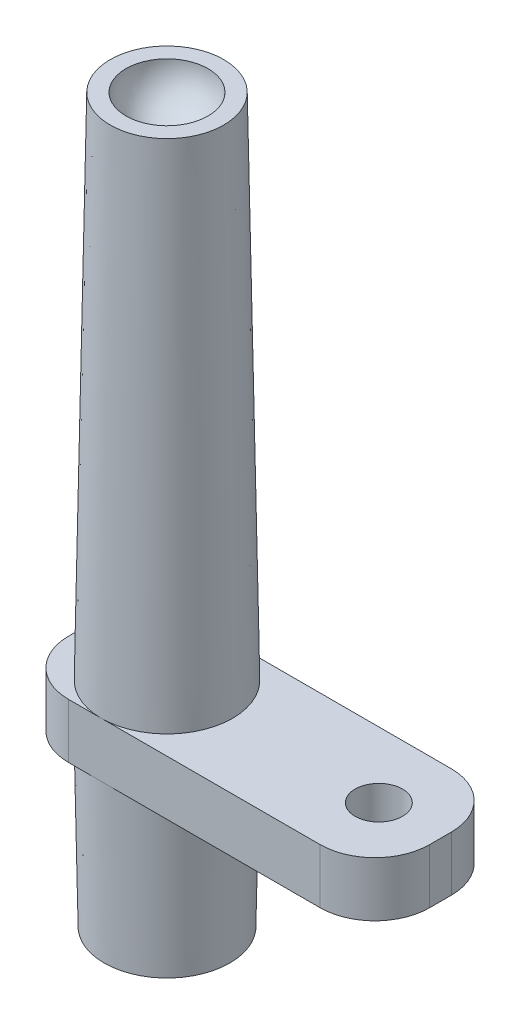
ISO-10303-21;
HEADER;
FILE_DESCRIPTION(('STEP AP214'),'2;1');
FILE_NAME('part.step','',(''),(''),'','','');
FILE_SCHEMA(('AUTOMOTIVE_DESIGN { 1 0 10303 214 1 1 1 1 }'));
ENDSEC;
DATA;
#1=APPLICATION_CONTEXT('core data for automotive mechanical design processes');
#2=APPLICATION_PROTOCOL_DEFINITION('international standard','automotive_design',2000,#1);
#3=PRODUCT_CONTEXT('',#1,'mechanical');
#4=PRODUCT('Part','Part','',(#3));
#5=PRODUCT_RELATED_PRODUCT_CATEGORY('part','',(#4));
#6=PRODUCT_DEFINITION_FORMATION('','',#4);
#7=PRODUCT_DEFINITION_CONTEXT('part definition',#1,'design');
#8=PRODUCT_DEFINITION('design','',#6,#7);
#9=PRODUCT_DEFINITION_SHAPE('','',#8);
#10=(LENGTH_UNIT() NAMED_UNIT(*) SI_UNIT(.MILLI.,.METRE.));
#11=(NAMED_UNIT(*) PLANE_ANGLE_UNIT() SI_UNIT($,.RADIAN.));
#12=(NAMED_UNIT(*) SI_UNIT($,.STERADIAN.) SOLID_ANGLE_UNIT());
#13=UNCERTAINTY_MEASURE_WITH_UNIT(LENGTH_MEASURE(1.E-05),#10,'distance_accuracy_value','');
#14=(GEOMETRIC_REPRESENTATION_CONTEXT(3) GLOBAL_UNCERTAINTY_ASSIGNED_CONTEXT((#13)) GLOBAL_UNIT_ASSIGNED_CONTEXT((#10,
#11,#12)) REPRESENTATION_CONTEXT('',''));
#15=CARTESIAN_POINT('',(0.,0.,0.));
#16=DIRECTION('',(0.,0.,1.));
#17=DIRECTION('',(1.,0.,0.));
#18=AXIS2_PLACEMENT_3D('',#15,#16,#17);
#19=CARTESIAN_POINT('',(-2.159,-4.064,0.));
#20=CARTESIAN_POINT('',(-2.126290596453,-4.044393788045,-0.5199010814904));
#21=CARTESIAN_POINT('',(-2.094655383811,-3.910545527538,-1.022728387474));
#22=CARTESIAN_POINT('',(-2.065647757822,-3.669027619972,-1.483791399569));
#23=CARTESIAN_POINT('',(-2.159,-4.064,0.));
#24=CARTESIAN_POINT('',(-2.446236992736,-4.044393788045,-0.5400304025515));
#25=CARTESIAN_POINT('',(-2.724040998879,-3.910545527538,-1.06232597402));
#26=CARTESIAN_POINT('',(-2.978770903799,-3.669027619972,-1.54124023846));
#27=CARTESIAN_POINT('',(-2.159,-4.064,0.));
#28=CARTESIAN_POINT('',(-2.679929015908,-4.044393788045,-0.3205789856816));
#29=CARTESIAN_POINT('',(-3.183750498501,-3.910545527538,-0.6306300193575));
#30=CARTESIAN_POINT('',(-3.645725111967,-3.669027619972,-0.9149285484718));
#31=CARTESIAN_POINT('',(-2.159,-4.064,0.));
#32=CARTESIAN_POINT('',(-2.679929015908,-4.044393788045,0.));
#33=CARTESIAN_POINT('',(-3.183750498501,-3.910545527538,0.));
#34=CARTESIAN_POINT('',(-3.645725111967,-3.669027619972,0.));
#35=CARTESIAN_POINT('',(-2.159,-4.064,0.));
#36=CARTESIAN_POINT('',(-2.679929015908,-4.044393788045,0.3205789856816));
#37=CARTESIAN_POINT('',(-3.183750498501,-3.910545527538,0.6306300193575));
#38=CARTESIAN_POINT('',(-3.645725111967,-3.669027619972,0.9149285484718));
#39=CARTESIAN_POINT('',(-2.159,-4.064,0.));
#40=CARTESIAN_POINT('',(-2.446236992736,-4.044393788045,0.5400304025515));
#41=CARTESIAN_POINT('',(-2.724040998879,-3.910545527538,1.06232597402));
#42=CARTESIAN_POINT('',(-2.978770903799,-3.669027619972,1.54124023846));
#43=CARTESIAN_POINT('',(-2.159,-4.064,0.));
#44=CARTESIAN_POINT('',(-2.126290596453,-4.044393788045,0.5199010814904));
#45=CARTESIAN_POINT('',(-2.094655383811,-3.910545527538,1.022728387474));
#46=CARTESIAN_POINT('',(-2.065647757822,-3.669027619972,1.483791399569));
#47=(BOUNDED_SURFACE() B_SPLINE_SURFACE(3,3,((#19,#20,#21,#22),(#23,#24,#25,#26),(#27,#28,#29,
#30),(#31,#32,#33,#34),(#35,#36,#37,#38),(#39,#40,#41,#42),(#43,#44,#45,#46)),.UNSPECIFIED.,.F.,
.F.,.F.) B_SPLINE_SURFACE_WITH_KNOTS((4,3,4),(4,4),(0.,1.,2.),(0.,1.),
.UNSPECIFIED.) GEOMETRIC_REPRESENTATION_ITEM() RATIONAL_B_SPLINE_SURFACE(((1.202018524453,
1.182344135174,1.182344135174,1.202018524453),(0.9492317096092,0.9336948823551,0.9336948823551,
0.9492317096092),(0.9492317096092,0.9336948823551,0.9336948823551,0.9492317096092),
(1.202018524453,1.182344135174,1.182344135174,1.202018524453),(0.9492317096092,0.9336948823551,
0.9336948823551,0.9492317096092),(0.9492317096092,0.9336948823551,0.9336948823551,
0.9492317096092),(1.202018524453,1.182344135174,1.182344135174,1.202018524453))) REPRESENTATION_ITEM('') SURFACE());
#48=CARTESIAN_POINT('',(-2.15900000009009,-0.573971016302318,0.131354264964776));
#49=DIRECTION('',(1.,-3.19033628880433E-13,6.9481776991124E-10));
#50=DIRECTION('',(6.9481776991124E-10,0.,-1.));
#51=AXIS2_PLACEMENT_3D('',#48,#49,#50);
#52=CIRCLE('',#51,3.49249999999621);
#53=CARTESIAN_POINT('',(-2.15899999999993,-4.06399999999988,0.));
#54=VERTEX_POINT('',#53);
#55=CARTESIAN_POINT('',(-2.1589999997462,-3.68300000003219,-1.45971299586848));
#56=VERTEX_POINT('',#55);
#57=EDGE_CURVE('E108',#54,#56,#52,.T.);
#58=CARTESIAN_POINT('',(-2.1589999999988,-0.573971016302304,-0.131354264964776));
#59=DIRECTION('',(1.,-3.1778407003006E-13,1.86788451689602E-13));
#60=DIRECTION('',(3.1778407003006E-13,1.,0.));
#61=AXIS2_PLACEMENT_3D('',#58,#59,#60);
#62=CIRCLE('',#61,3.49249999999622);
#63=CARTESIAN_POINT('',(-2.15900000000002,-3.68300000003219,1.45971299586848));
#64=VERTEX_POINT('',#63);
#65=EDGE_CURVE('E110',#64,#54,#62,.T.);
#66=CARTESIAN_POINT('',(-2.159,-3.68300000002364,0.));
#67=DIRECTION('',(0.,1.,0.));
#68=DIRECTION('',(0.,0.,1.));
#69=AXIS2_PLACEMENT_3D('',#66,#67,#68);
#70=CIRCLE('',#69,1.45971299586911);
#71=EDGE_CURVE('E105',#56,#64,#70,.T.);
#72=ORIENTED_EDGE('',*,*,#57,.F.);
#73=ORIENTED_EDGE('',*,*,#65,.F.);
#74=ORIENTED_EDGE('',*,*,#71,.F.);
#75=EDGE_LOOP('',(#72,#73,#74));
#76=FACE_BOUND('',#75,.T.);
#77=ADVANCED_FACE('F17',(#76),#47,.T.);
#78=CARTESIAN_POINT('',(-2.159,-4.064,0.));
#79=CARTESIAN_POINT('',(-2.191709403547,-4.044393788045,0.5199010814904));
#80=CARTESIAN_POINT('',(-2.223344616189,-3.910545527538,1.022728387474));
#81=CARTESIAN_POINT('',(-2.252352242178,-3.669027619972,1.483791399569));
#82=CARTESIAN_POINT('',(-2.159,-4.064,0.));
#83=CARTESIAN_POINT('',(-1.871763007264,-4.044393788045,0.5400304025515));
#84=CARTESIAN_POINT('',(-1.593959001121,-3.910545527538,1.06232597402));
#85=CARTESIAN_POINT('',(-1.339229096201,-3.669027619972,1.54124023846));
#86=CARTESIAN_POINT('',(-2.159,-4.064,0.));
#87=CARTESIAN_POINT('',(-1.638070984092,-4.044393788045,0.3205789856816));
#88=CARTESIAN_POINT('',(-1.134249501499,-3.910545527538,0.6306300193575));
#89=CARTESIAN_POINT('',(-0.6722748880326,-3.669027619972,0.9149285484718));
#90=CARTESIAN_POINT('',(-2.159,-4.064,0.));
#91=CARTESIAN_POINT('',(-1.638070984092,-4.044393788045,0.));
#92=CARTESIAN_POINT('',(-1.134249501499,-3.910545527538,0.));
#93=CARTESIAN_POINT('',(-0.6722748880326,-3.669027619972,0.));
#94=CARTESIAN_POINT('',(-2.159,-4.064,0.));
#95=CARTESIAN_POINT('',(-1.638070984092,-4.044393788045,-0.3205789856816));
#96=CARTESIAN_POINT('',(-1.134249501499,-3.910545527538,-0.6306300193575));
#97=CARTESIAN_POINT('',(-0.6722748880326,-3.669027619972,-0.9149285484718));
#98=CARTESIAN_POINT('',(-2.159,-4.064,0.));
#99=CARTESIAN_POINT('',(-1.871763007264,-4.044393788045,-0.5400304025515));
#100=CARTESIAN_POINT('',(-1.593959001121,-3.910545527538,-1.06232597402));
#101=CARTESIAN_POINT('',(-1.339229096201,-3.669027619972,-1.54124023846));
#102=CARTESIAN_POINT('',(-2.159,-4.064,0.));
#103=CARTESIAN_POINT('',(-2.191709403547,-4.044393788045,-0.5199010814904));
#104=CARTESIAN_POINT('',(-2.223344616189,-3.910545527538,-1.022728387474));
#105=CARTESIAN_POINT('',(-2.252352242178,-3.669027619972,-1.483791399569));
#106=(BOUNDED_SURFACE() B_SPLINE_SURFACE(3,3,((#78,#79,#80,#81),(#82,#83,#84,#85),(#86,#87,#88,
#89),(#90,#91,#92,#93),(#94,#95,#96,#97),(#98,#99,#100,#101),(#102,#103,#104,#105)),
.UNSPECIFIED.,.F.,.F.,.F.) B_SPLINE_SURFACE_WITH_KNOTS((4,3,4),(4,4),(0.,1.,2.),(0.,1.),
.UNSPECIFIED.) GEOMETRIC_REPRESENTATION_ITEM() RATIONAL_B_SPLINE_SURFACE(((1.202018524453,
1.182344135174,1.182344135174,1.202018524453),(0.9492317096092,0.9336948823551,0.9336948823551,
0.9492317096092),(0.9492317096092,0.9336948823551,0.9336948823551,0.9492317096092),
(1.202018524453,1.182344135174,1.182344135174,1.202018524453),(0.9492317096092,0.9336948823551,
0.9336948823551,0.9492317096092),(0.9492317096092,0.9336948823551,0.9336948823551,
0.9492317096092),(1.202018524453,1.182344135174,1.182344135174,1.202018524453))) REPRESENTATION_ITEM('') SURFACE());
#107=CARTESIAN_POINT('',(-2.159,-3.68300000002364,0.));
#108=DIRECTION('',(0.,1.,0.));
#109=DIRECTION('',(0.,0.,1.));
#110=AXIS2_PLACEMENT_3D('',#107,#108,#109);
#111=CIRCLE('',#110,1.45971299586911);
#112=EDGE_CURVE('E116',#64,#56,#111,.T.);
#113=ORIENTED_EDGE('',*,*,#65,.T.);
#114=ORIENTED_EDGE('',*,*,#57,.T.);
#115=ORIENTED_EDGE('',*,*,#112,.F.);
#116=EDGE_LOOP('',(#113,#114,#115));
#117=FACE_BOUND('',#116,.T.);
#118=ADVANCED_FACE('F115',(#117),#106,.T.);
#119=CARTESIAN_POINT('',(-2.159,-5.6843418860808E-11,0.));
#120=DIRECTION('',(0.,1.,0.));
#121=DIRECTION('',(0.,0.,1.));
#122=AXIS2_PLACEMENT_3D('',#119,#120,#121);
#123=CONICAL_SURFACE('',#122,1.52399999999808,0.0174532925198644);
#124=CARTESIAN_POINT('',(-2.159,0.,0.));
#125=DIRECTION('',(0.,1.,0.));
#126=DIRECTION('',(0.,0.,1.));
#127=AXIS2_PLACEMENT_3D('',#124,#125,#126);
#128=CIRCLE('',#127,1.52399999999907);
#129=CARTESIAN_POINT('',(-2.159,-1.4210854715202E-11,1.52399999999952));
#130=VERTEX_POINT('',#129);
#131=CARTESIAN_POINT('',(-2.15899999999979,-1.42143783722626E-11,-1.52399999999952));
#132=VERTEX_POINT('',#131);
#133=EDGE_CURVE('E21',#130,#132,#128,.F.);
#134=ORIENTED_EDGE('',*,*,#133,.T.);
#135=CARTESIAN_POINT('',(-2.159,0.,0.));
#136=DIRECTION('',(0.,1.,0.));
#137=DIRECTION('',(0.,0.,1.));
#138=AXIS2_PLACEMENT_3D('',#135,#136,#137);
#139=CIRCLE('',#138,1.52399999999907);
#140=EDGE_CURVE('E174',#132,#130,#139,.F.);
#141=ORIENTED_EDGE('',*,*,#140,.T.);
#142=EDGE_LOOP('',(#134,#141));
#143=FACE_BOUND('',#142,.T.);
#144=ORIENTED_EDGE('',*,*,#112,.T.);
#145=ORIENTED_EDGE('',*,*,#71,.T.);
#146=EDGE_LOOP('',(#144,#145));
#147=FACE_BOUND('',#146,.T.);
#148=ADVANCED_FACE('F193',(#143,#147),#123,.T.);
#149=CARTESIAN_POINT('',(-4.191,0.,1.524));
#150=DIRECTION('',(0.,1.,0.));
#151=DIRECTION('',(0.,0.,1.));
#152=AXIS2_PLACEMENT_3D('',#149,#150,#151);
#153=PLANE('',#152);
#154=CARTESIAN_POINT('',(-2.921,0.,-0.254));
#155=DIRECTION('',(0.,-1.,0.));
#156=DIRECTION('',(0.,0.,-1.));
#157=AXIS2_PLACEMENT_3D('',#154,#155,#156);
#158=CIRCLE('',#157,1.27);
#159=CARTESIAN_POINT('',(-2.921,0.,-1.52399999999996));
#160=VERTEX_POINT('',#159);
#161=CARTESIAN_POINT('',(-4.191,0.,-0.254));
#162=VERTEX_POINT('',#161);
#163=EDGE_CURVE('E171',#160,#162,#158,.F.);
#164=ORIENTED_EDGE('',*,*,#163,.F.);
#165=DIRECTION('',(1.,0.,0.));
#166=VECTOR('',#165,1.);
#167=CARTESIAN_POINT('',(-4.191,0.,-1.52399999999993));
#168=LINE('',#167,#166);
#169=EDGE_CURVE('E176',#132,#160,#168,.F.);
#170=ORIENTED_EDGE('',*,*,#169,.F.);
#171=ORIENTED_EDGE('',*,*,#133,.F.);
#172=DIRECTION('',(1.,0.,0.));
#173=VECTOR('',#172,1.);
#174=CARTESIAN_POINT('',(-4.191,0.,1.524));
#175=LINE('',#174,#173);
#176=CARTESIAN_POINT('',(-2.921,0.,1.524));
#177=VERTEX_POINT('',#176);
#178=EDGE_CURVE('E96',#177,#130,#175,.T.);
#179=ORIENTED_EDGE('',*,*,#178,.F.);
#180=CARTESIAN_POINT('',(-2.921,0.,0.254));
#181=DIRECTION('',(0.,-1.,0.));
#182=DIRECTION('',(0.,0.,-1.));
#183=AXIS2_PLACEMENT_3D('',#180,#181,#182);
#184=CIRCLE('',#183,1.27);
#185=CARTESIAN_POINT('',(-4.191,0.,0.254));
#186=VERTEX_POINT('',#185);
#187=EDGE_CURVE('E167',#186,#177,#184,.F.);
#188=ORIENTED_EDGE('',*,*,#187,.F.);
#189=DIRECTION('',(0.,0.,-1.));
#190=VECTOR('',#189,1.);
#191=CARTESIAN_POINT('',(-4.191,0.,-1.524));
#192=LINE('',#191,#190);
#193=EDGE_CURVE('E173',#186,#162,#192,.T.);
#194=ORIENTED_EDGE('',*,*,#193,.T.);
#195=EDGE_LOOP('',(#164,#170,#171,#179,#188,#194));
#196=FACE_BOUND('',#195,.T.);
#197=ADVANCED_FACE('F195',(#196),#153,.F.);
#198=CARTESIAN_POINT('',(-4.191,0.,1.524));
#199=DIRECTION('',(0.,1.,0.));
#200=DIRECTION('',(0.,0.,1.));
#201=AXIS2_PLACEMENT_3D('',#198,#199,#200);
#202=PLANE('',#201);
#203=ORIENTED_EDGE('',*,*,#140,.F.);
#204=DIRECTION('',(1.,0.,0.));
#205=VECTOR('',#204,1.);
#206=CARTESIAN_POINT('',(-4.191,0.,-1.524));
#207=LINE('',#206,#205);
#208=CARTESIAN_POINT('',(2.921,0.,-1.524));
#209=VERTEX_POINT('',#208);
#210=EDGE_CURVE('E154',#132,#209,#207,.T.);
#211=ORIENTED_EDGE('',*,*,#210,.T.);
#212=CARTESIAN_POINT('',(2.921,0.,-0.254));
#213=DIRECTION('',(0.,-1.,0.));
#214=DIRECTION('',(0.,0.,-1.));
#215=AXIS2_PLACEMENT_3D('',#212,#213,#214);
#216=CIRCLE('',#215,1.27);
#217=CARTESIAN_POINT('',(4.191,0.,-0.254));
#218=VERTEX_POINT('',#217);
#219=EDGE_CURVE('E155',#218,#209,#216,.F.);
#220=ORIENTED_EDGE('',*,*,#219,.F.);
#221=DIRECTION('',(0.,0.,1.));
#222=VECTOR('',#221,1.);
#223=CARTESIAN_POINT('',(4.191,0.,-1.524));
#224=LINE('',#223,#222);
#225=CARTESIAN_POINT('',(4.191,0.,0.254));
#226=VERTEX_POINT('',#225);
#227=EDGE_CURVE('E287',#218,#226,#224,.T.);
#228=ORIENTED_EDGE('',*,*,#227,.T.);
#229=CARTESIAN_POINT('',(2.921,0.,0.254));
#230=DIRECTION('',(0.,-1.,0.));
#231=DIRECTION('',(0.,0.,-1.));
#232=AXIS2_PLACEMENT_3D('',#229,#230,#231);
#233=CIRCLE('',#232,1.27);
#234=CARTESIAN_POINT('',(2.921,0.,1.524));
#235=VERTEX_POINT('',#234);
#236=EDGE_CURVE('E159',#235,#226,#233,.F.);
#237=ORIENTED_EDGE('',*,*,#236,.F.);
#238=DIRECTION('',(-1.,0.,0.));
#239=VECTOR('',#238,1.);
#240=CARTESIAN_POINT('',(-4.191,0.,1.524));
#241=LINE('',#240,#239);
#242=EDGE_CURVE('E166',#235,#130,#241,.T.);
#243=ORIENTED_EDGE('',*,*,#242,.T.);
#244=EDGE_LOOP('',(#203,#211,#220,#228,#237,#243));
#245=FACE_BOUND('',#244,.T.);
#246=CARTESIAN_POINT('',(2.75844,0.,0.));
#247=DIRECTION('',(0.,1.,0.));
#248=DIRECTION('',(0.,0.,1.));
#249=AXIS2_PLACEMENT_3D('',#246,#247,#248);
#250=CIRCLE('',#249,0.55);
#251=CARTESIAN_POINT('',(2.75844,0.,0.55));
#252=VERTEX_POINT('',#251);
#253=EDGE_CURVE('E163',#252,#252,#250,.T.);
#254=ORIENTED_EDGE('',*,*,#253,.T.);
#255=EDGE_LOOP('',(#254));
#256=FACE_BOUND('',#255,.T.);
#257=ADVANCED_FACE('F202',(#245,#256),#202,.F.);
#258=CARTESIAN_POINT('',(-2.921,1.27,-0.254));
#259=DIRECTION('',(0.,-1.,0.));
#260=DIRECTION('',(0.,0.,-1.));
#261=AXIS2_PLACEMENT_3D('',#258,#259,#260);
#262=CYLINDRICAL_SURFACE('',#261,1.27);
#263=DIRECTION('',(0.,1.,0.));
#264=VECTOR('',#263,1.);
#265=CARTESIAN_POINT('',(-2.921,1.27,-1.524));
#266=LINE('',#265,#264);
#267=CARTESIAN_POINT('',(-2.921,1.27,-1.52399999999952));
#268=VERTEX_POINT('',#267);
#269=EDGE_CURVE('E276',#268,#160,#266,.F.);
#270=ORIENTED_EDGE('',*,*,#269,.T.);
#271=ORIENTED_EDGE('',*,*,#163,.T.);
#272=DIRECTION('',(0.,1.,0.));
#273=VECTOR('',#272,1.);
#274=CARTESIAN_POINT('',(-4.191,1.27,-0.254));
#275=LINE('',#274,#273);
#276=CARTESIAN_POINT('',(-4.191,1.27,-0.254));
#277=VERTEX_POINT('',#276);
#278=EDGE_CURVE('E189',#162,#277,#275,.T.);
#279=ORIENTED_EDGE('',*,*,#278,.T.);
#280=CARTESIAN_POINT('',(-2.921,1.27,-0.254));
#281=DIRECTION('',(0.,-1.,0.));
#282=DIRECTION('',(0.,0.,-1.));
#283=AXIS2_PLACEMENT_3D('',#280,#281,#282);
#284=CIRCLE('',#283,1.27);
#285=EDGE_CURVE('E151',#268,#277,#284,.F.);
#286=ORIENTED_EDGE('',*,*,#285,.F.);
#287=EDGE_LOOP('',(#270,#271,#279,#286));
#288=FACE_BOUND('',#287,.T.);
#289=ADVANCED_FACE('F255',(#288),#262,.T.);
#290=CARTESIAN_POINT('',(-4.191,1.27,-1.524));
#291=DIRECTION('',(1.,0.,0.));
#292=DIRECTION('',(0.,0.,-1.));
#293=AXIS2_PLACEMENT_3D('',#290,#291,#292);
#294=PLANE('',#293);
#295=ORIENTED_EDGE('',*,*,#278,.F.);
#296=ORIENTED_EDGE('',*,*,#193,.F.);
#297=DIRECTION('',(0.,-1.,0.));
#298=VECTOR('',#297,1.);
#299=CARTESIAN_POINT('',(-4.191,1.27,0.254));
#300=LINE('',#299,#298);
#301=CARTESIAN_POINT('',(-4.191,1.27,0.254));
#302=VERTEX_POINT('',#301);
#303=EDGE_CURVE('E170',#302,#186,#300,.T.);
#304=ORIENTED_EDGE('',*,*,#303,.F.);
#305=DIRECTION('',(0.,0.,1.));
#306=VECTOR('',#305,1.);
#307=CARTESIAN_POINT('',(-4.191,1.27,1.524));
#308=LINE('',#307,#306);
#309=EDGE_CURVE('E150',#277,#302,#308,.T.);
#310=ORIENTED_EDGE('',*,*,#309,.F.);
#311=EDGE_LOOP('',(#295,#296,#304,#310));
#312=FACE_BOUND('',#311,.T.);
#313=ADVANCED_FACE('F251',(#312),#294,.F.);
#314=CARTESIAN_POINT('',(-2.921,1.27,0.254));
#315=DIRECTION('',(0.,-1.,0.));
#316=DIRECTION('',(0.,0.,-1.));
#317=AXIS2_PLACEMENT_3D('',#314,#315,#316);
#318=CYLINDRICAL_SURFACE('',#317,1.27);
#319=ORIENTED_EDGE('',*,*,#303,.T.);
#320=ORIENTED_EDGE('',*,*,#187,.T.);
#321=DIRECTION('',(0.,1.,0.));
#322=VECTOR('',#321,1.);
#323=CARTESIAN_POINT('',(-2.921,1.27,1.524));
#324=LINE('',#323,#322);
#325=CARTESIAN_POINT('',(-2.921,1.27,1.524));
#326=VERTEX_POINT('',#325);
#327=EDGE_CURVE('E283',#177,#326,#324,.T.);
#328=ORIENTED_EDGE('',*,*,#327,.T.);
#329=CARTESIAN_POINT('',(-2.921,1.27,0.254));
#330=DIRECTION('',(0.,-1.,0.));
#331=DIRECTION('',(0.,0.,-1.));
#332=AXIS2_PLACEMENT_3D('',#329,#330,#331);
#333=CIRCLE('',#332,1.27);
#334=EDGE_CURVE('E146',#302,#326,#333,.F.);
#335=ORIENTED_EDGE('',*,*,#334,.F.);
#336=EDGE_LOOP('',(#319,#320,#328,#335));
#337=FACE_BOUND('',#336,.T.);
#338=ADVANCED_FACE('F248',(#337),#318,.T.);
#339=CARTESIAN_POINT('',(-2.159,13.0937,0.));
#340=DIRECTION('',(0.,0.,-1.));
#341=DIRECTION('',(-1.,0.,0.));
#342=AXIS2_PLACEMENT_3D('',#339,#340,#341);
#343=SPHERICAL_SURFACE('',#342,0.9525);
#344=CARTESIAN_POINT('',(-2.159,13.0937,0.));
#345=DIRECTION('',(9.36677604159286E-13,1.,0.));
#346=DIRECTION('',(-1.,9.36677604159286E-13,0.));
#347=AXIS2_PLACEMENT_3D('',#344,#345,#346);
#348=SPHERICAL_SURFACE('',#347,0.9525);
#349=CARTESIAN_POINT('',(-2.159,13.0937,0.));
#350=DIRECTION('',(9.36677604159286E-13,1.,0.));
#351=DIRECTION('',(-1.,9.36677604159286E-13,0.));
#352=AXIS2_PLACEMENT_3D('',#349,#350,#351);
#353=CIRCLE('',#352,0.9525);
#354=CARTESIAN_POINT('',(-3.1115,13.0937000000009,0.));
#355=VERTEX_POINT('',#354);
#356=EDGE_CURVE('E143',#355,#355,#353,.F.);
#357=ORIENTED_EDGE('',*,*,#356,.F.);
#358=EDGE_LOOP('',(#357));
#359=FACE_BOUND('',#358,.T.);
#360=ADVANCED_FACE('F19',(#359),#348,.F.);
#361=CARTESIAN_POINT('',(2.75844,1.27,0.));
#362=DIRECTION('',(0.,1.,0.));
#363=DIRECTION('',(0.,0.,1.));
#364=AXIS2_PLACEMENT_3D('',#361,#362,#363);
#365=CYLINDRICAL_SURFACE('',#364,0.55);
#366=ORIENTED_EDGE('',*,*,#253,.F.);
#367=EDGE_LOOP('',(#366));
#368=FACE_BOUND('',#367,.T.);
#369=CARTESIAN_POINT('',(2.75844,1.27,0.));
#370=DIRECTION('',(0.,1.,0.));
#371=DIRECTION('',(0.,0.,1.));
#372=AXIS2_PLACEMENT_3D('',#369,#370,#371);
#373=CIRCLE('',#372,0.55);
#374=CARTESIAN_POINT('',(2.75844,1.27,0.55));
#375=VERTEX_POINT('',#374);
#376=EDGE_CURVE('E140',#375,#375,#373,.F.);
#377=ORIENTED_EDGE('',*,*,#376,.F.);
#378=EDGE_LOOP('',(#377));
#379=FACE_BOUND('',#378,.T.);
#380=ADVANCED_FACE('F244',(#368,#379),#365,.F.);
#381=CARTESIAN_POINT('',(-4.191,1.27,1.524));
#382=DIRECTION('',(0.,0.,-1.));
#383=DIRECTION('',(-1.,0.,0.));
#384=AXIS2_PLACEMENT_3D('',#381,#382,#383);
#385=PLANE('',#384);
#386=DIRECTION('',(1.,0.,0.));
#387=VECTOR('',#386,1.);
#388=CARTESIAN_POINT('',(-4.191,1.27,1.524));
#389=LINE('',#388,#387);
#390=CARTESIAN_POINT('',(-2.159,1.2699999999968,1.52399999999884));
#391=VERTEX_POINT('',#390);
#392=EDGE_CURVE('E149',#326,#391,#389,.T.);
#393=ORIENTED_EDGE('',*,*,#392,.F.);
#394=ORIENTED_EDGE('',*,*,#327,.F.);
#395=ORIENTED_EDGE('',*,*,#178,.T.);
#396=ORIENTED_EDGE('',*,*,#242,.F.);
#397=DIRECTION('',(0.,-1.,0.));
#398=VECTOR('',#397,1.);
#399=CARTESIAN_POINT('',(2.921,1.27,1.524));
#400=LINE('',#399,#398);
#401=CARTESIAN_POINT('',(2.921,1.27,1.52399999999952));
#402=VERTEX_POINT('',#401);
#403=EDGE_CURVE('E162',#402,#235,#400,.T.);
#404=ORIENTED_EDGE('',*,*,#403,.F.);
#405=DIRECTION('',(1.,0.,0.));
#406=VECTOR('',#405,1.);
#407=CARTESIAN_POINT('',(-4.191,1.27,1.52399999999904));
#408=LINE('',#407,#406);
#409=EDGE_CURVE('E139',#391,#402,#408,.T.);
#410=ORIENTED_EDGE('',*,*,#409,.F.);
#411=EDGE_LOOP('',(#393,#394,#395,#396,#404,#410));
#412=FACE_BOUND('',#411,.T.);
#413=ADVANCED_FACE('F240',(#412),#385,.F.);
#414=CARTESIAN_POINT('',(2.921,1.27,0.254));
#415=DIRECTION('',(0.,-1.,0.));
#416=DIRECTION('',(0.,0.,-1.));
#417=AXIS2_PLACEMENT_3D('',#414,#415,#416);
#418=CYLINDRICAL_SURFACE('',#417,1.27);
#419=ORIENTED_EDGE('',*,*,#403,.T.);
#420=ORIENTED_EDGE('',*,*,#236,.T.);
#421=DIRECTION('',(0.,1.,0.));
#422=VECTOR('',#421,1.);
#423=CARTESIAN_POINT('',(4.191,1.27,0.254));
#424=LINE('',#423,#422);
#425=CARTESIAN_POINT('',(4.191,1.27,0.254));
#426=VERTEX_POINT('',#425);
#427=EDGE_CURVE('E161',#226,#426,#424,.T.);
#428=ORIENTED_EDGE('',*,*,#427,.T.);
#429=CARTESIAN_POINT('',(2.921,1.27,0.254));
#430=DIRECTION('',(0.,-1.,0.));
#431=DIRECTION('',(0.,0.,-1.));
#432=AXIS2_PLACEMENT_3D('',#429,#430,#431);
#433=CIRCLE('',#432,1.27);
#434=EDGE_CURVE('E136',#402,#426,#433,.F.);
#435=ORIENTED_EDGE('',*,*,#434,.F.);
#436=EDGE_LOOP('',(#419,#420,#428,#435));
#437=FACE_BOUND('',#436,.T.);
#438=ADVANCED_FACE('F236',(#437),#418,.T.);
#439=CARTESIAN_POINT('',(4.191,1.27,-1.524));
#440=DIRECTION('',(-1.,0.,0.));
#441=DIRECTION('',(0.,0.,1.));
#442=AXIS2_PLACEMENT_3D('',#439,#440,#441);
#443=PLANE('',#442);
#444=DIRECTION('',(0.,-1.,0.));
#445=VECTOR('',#444,1.);
#446=CARTESIAN_POINT('',(4.191,1.27,-0.254));
#447=LINE('',#446,#445);
#448=CARTESIAN_POINT('',(4.191,1.27,-0.254));
#449=VERTEX_POINT('',#448);
#450=EDGE_CURVE('E158',#449,#218,#447,.T.);
#451=ORIENTED_EDGE('',*,*,#450,.F.);
#452=DIRECTION('',(0.,0.,1.));
#453=VECTOR('',#452,1.);
#454=CARTESIAN_POINT('',(4.191,1.27,1.524));
#455=LINE('',#454,#453);
#456=EDGE_CURVE('E135',#426,#449,#455,.F.);
#457=ORIENTED_EDGE('',*,*,#456,.F.);
#458=ORIENTED_EDGE('',*,*,#427,.F.);
#459=ORIENTED_EDGE('',*,*,#227,.F.);
#460=EDGE_LOOP('',(#451,#457,#458,#459));
#461=FACE_BOUND('',#460,.T.);
#462=ADVANCED_FACE('F232',(#461),#443,.F.);
#463=CARTESIAN_POINT('',(2.921,1.27,-0.254));
#464=DIRECTION('',(0.,-1.,0.));
#465=DIRECTION('',(0.,0.,-1.));
#466=AXIS2_PLACEMENT_3D('',#463,#464,#465);
#467=CYLINDRICAL_SURFACE('',#466,1.27);
#468=ORIENTED_EDGE('',*,*,#450,.T.);
#469=ORIENTED_EDGE('',*,*,#219,.T.);
#470=DIRECTION('',(0.,1.,0.));
#471=VECTOR('',#470,1.);
#472=CARTESIAN_POINT('',(2.921,1.27,-1.524));
#473=LINE('',#472,#471);
#474=CARTESIAN_POINT('',(2.921,1.27,-1.524));
#475=VERTEX_POINT('',#474);
#476=EDGE_CURVE('E157',#209,#475,#473,.T.);
#477=ORIENTED_EDGE('',*,*,#476,.T.);
#478=CARTESIAN_POINT('',(2.921,1.27,-0.254));
#479=DIRECTION('',(0.,-1.,0.));
#480=DIRECTION('',(0.,0.,-1.));
#481=AXIS2_PLACEMENT_3D('',#478,#479,#480);
#482=CIRCLE('',#481,1.27);
#483=EDGE_CURVE('E132',#449,#475,#482,.F.);
#484=ORIENTED_EDGE('',*,*,#483,.F.);
#485=EDGE_LOOP('',(#468,#469,#477,#484));
#486=FACE_BOUND('',#485,.T.);
#487=ADVANCED_FACE('F229',(#486),#467,.T.);
#488=CARTESIAN_POINT('',(-4.191,1.27,-1.524));
#489=DIRECTION('',(0.,0.,1.));
#490=DIRECTION('',(1.,0.,0.));
#491=AXIS2_PLACEMENT_3D('',#488,#489,#490);
#492=PLANE('',#491);
#493=ORIENTED_EDGE('',*,*,#169,.T.);
#494=ORIENTED_EDGE('',*,*,#269,.F.);
#495=DIRECTION('',(1.,0.,0.));
#496=VECTOR('',#495,1.);
#497=CARTESIAN_POINT('',(-4.191,1.27,-1.52399999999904));
#498=LINE('',#497,#496);
#499=CARTESIAN_POINT('',(-2.159,1.2699999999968,-1.52399999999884));
#500=VERTEX_POINT('',#499);
#501=EDGE_CURVE('E36',#500,#268,#498,.F.);
#502=ORIENTED_EDGE('',*,*,#501,.F.);
#503=DIRECTION('',(1.,0.,0.));
#504=VECTOR('',#503,1.);
#505=CARTESIAN_POINT('',(-4.191,1.27,-1.524));
#506=LINE('',#505,#504);
#507=EDGE_CURVE('E131',#475,#500,#506,.F.);
#508=ORIENTED_EDGE('',*,*,#507,.F.);
#509=ORIENTED_EDGE('',*,*,#476,.F.);
#510=ORIENTED_EDGE('',*,*,#210,.F.);
#511=EDGE_LOOP('',(#493,#494,#502,#508,#509,#510));
#512=FACE_BOUND('',#511,.T.);
#513=ADVANCED_FACE('F225',(#512),#492,.F.);
#514=CARTESIAN_POINT('',(-4.191,1.27,1.524));
#515=DIRECTION('',(0.,1.,0.));
#516=DIRECTION('',(0.,0.,1.));
#517=AXIS2_PLACEMENT_3D('',#514,#515,#516);
#518=PLANE('',#517);
#519=CARTESIAN_POINT('',(-2.159,1.26999999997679,0.));
#520=DIRECTION('',(0.,-1.,0.));
#521=DIRECTION('',(0.,0.,-1.));
#522=AXIS2_PLACEMENT_3D('',#519,#520,#521);
#523=CIRCLE('',#522,1.5239999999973);
#524=EDGE_CURVE('E128',#500,#391,#523,.F.);
#525=ORIENTED_EDGE('',*,*,#524,.F.);
#526=ORIENTED_EDGE('',*,*,#501,.T.);
#527=ORIENTED_EDGE('',*,*,#285,.T.);
#528=ORIENTED_EDGE('',*,*,#309,.T.);
#529=ORIENTED_EDGE('',*,*,#334,.T.);
#530=ORIENTED_EDGE('',*,*,#392,.T.);
#531=EDGE_LOOP('',(#525,#526,#527,#528,#529,#530));
#532=FACE_BOUND('',#531,.T.);
#533=ADVANCED_FACE('F221',(#532),#518,.T.);
#534=CARTESIAN_POINT('',(-2.159,13.0937,0.));
#535=DIRECTION('',(0.,1.,0.));
#536=DIRECTION('',(0.,0.,1.));
#537=AXIS2_PLACEMENT_3D('',#534,#535,#536);
#538=PLANE('',#537);
#539=CARTESIAN_POINT('',(-2.159,13.0937000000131,0.));
#540=DIRECTION('',(0.,-1.,0.));
#541=DIRECTION('',(0.,0.,-1.));
#542=AXIS2_PLACEMENT_3D('',#539,#540,#541);
#543=CIRCLE('',#542,1.31761654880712);
#544=CARTESIAN_POINT('',(-2.159,13.0937000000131,-1.31761654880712));
#545=VERTEX_POINT('',#544);
#546=EDGE_CURVE('E27',#545,#545,#543,.T.);
#547=ORIENTED_EDGE('',*,*,#546,.F.);
#548=EDGE_LOOP('',(#547));
#549=FACE_BOUND('',#548,.T.);
#550=ORIENTED_EDGE('',*,*,#356,.T.);
#551=EDGE_LOOP('',(#550));
#552=FACE_BOUND('',#551,.T.);
#553=ADVANCED_FACE('F214',(#549,#552),#538,.T.);
#554=CARTESIAN_POINT('',(-4.191,1.27,1.524));
#555=DIRECTION('',(0.,1.,0.));
#556=DIRECTION('',(0.,0.,1.));
#557=AXIS2_PLACEMENT_3D('',#554,#555,#556);
#558=PLANE('',#557);
#559=ORIENTED_EDGE('',*,*,#483,.T.);
#560=ORIENTED_EDGE('',*,*,#507,.T.);
#561=CARTESIAN_POINT('',(-2.159,1.26999999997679,0.));
#562=DIRECTION('',(0.,-1.,0.));
#563=DIRECTION('',(0.,0.,-1.));
#564=AXIS2_PLACEMENT_3D('',#561,#562,#563);
#565=CIRCLE('',#564,1.5239999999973);
#566=EDGE_CURVE('E11',#391,#500,#565,.F.);
#567=ORIENTED_EDGE('',*,*,#566,.F.);
#568=ORIENTED_EDGE('',*,*,#409,.T.);
#569=ORIENTED_EDGE('',*,*,#434,.T.);
#570=ORIENTED_EDGE('',*,*,#456,.T.);
#571=EDGE_LOOP('',(#559,#560,#567,#568,#569,#570));
#572=FACE_BOUND('',#571,.T.);
#573=ORIENTED_EDGE('',*,*,#376,.T.);
#574=EDGE_LOOP('',(#573));
#575=FACE_BOUND('',#574,.T.);
#576=ADVANCED_FACE('F208',(#572,#575),#558,.T.);
#577=CARTESIAN_POINT('',(-2.159,1.27000000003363,0.));
#578=DIRECTION('',(0.,-1.,0.));
#579=DIRECTION('',(0.,0.,-1.));
#580=AXIS2_PLACEMENT_3D('',#577,#578,#579);
#581=CONICAL_SURFACE('',#580,1.52399999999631,0.0174532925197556);
#582=ORIENTED_EDGE('',*,*,#524,.T.);
#583=ORIENTED_EDGE('',*,*,#566,.T.);
#584=EDGE_LOOP('',(#582,#583));
#585=FACE_BOUND('',#584,.T.);
#586=ORIENTED_EDGE('',*,*,#546,.T.);
#587=EDGE_LOOP('',(#586));
#588=FACE_BOUND('',#587,.T.);
#589=ADVANCED_FACE('F206',(#585,#588),#581,.T.);
#590=CLOSED_SHELL('',(#77,#118,#148,#197,#257,#289,#313,#338,#360,#380,#413,#438,#462,#487,#513,
#533,#553,#576,#589));
#591=MANIFOLD_SOLID_BREP('B1',#590);
#592=ADVANCED_BREP_SHAPE_REPRESENTATION('',(#18,#591),#14);
#593=SHAPE_DEFINITION_REPRESENTATION(#9,#592);
ENDSEC;
END-ISO-10303-21;
